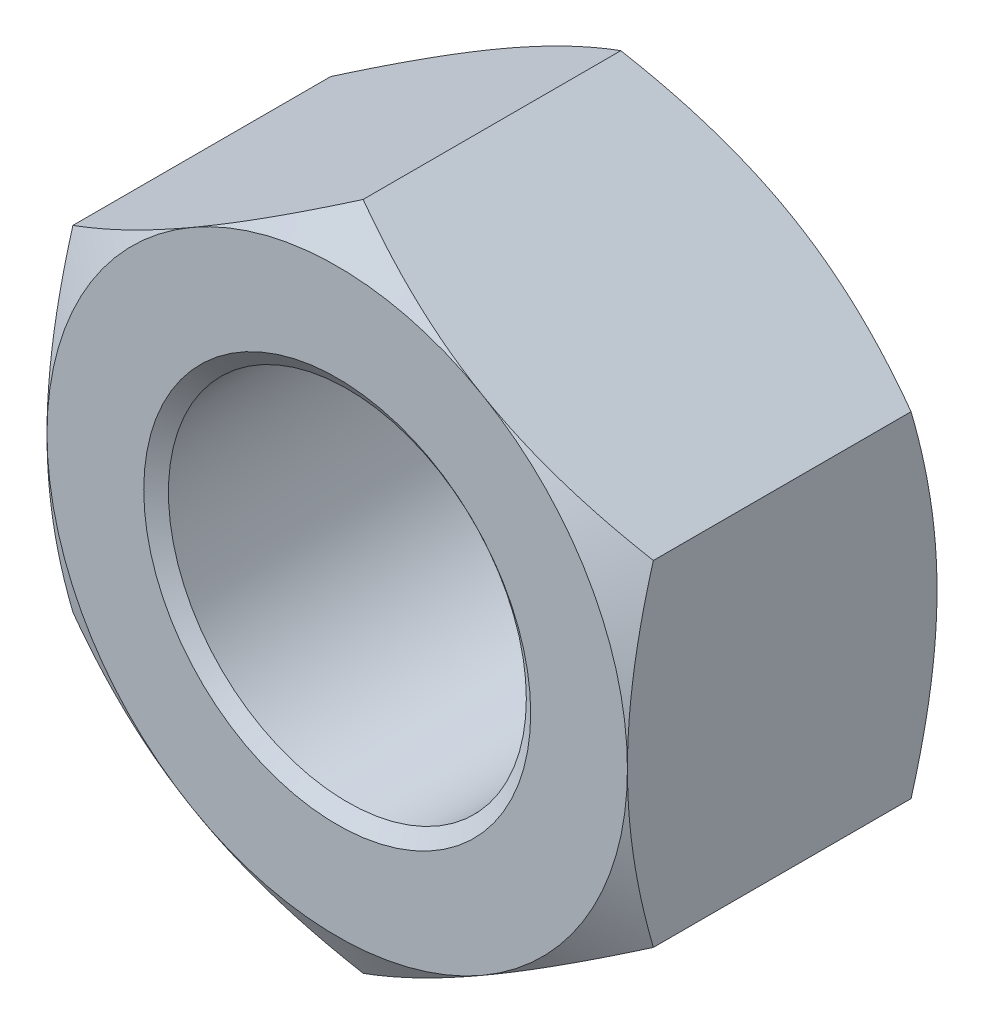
ISO-10303-21;
HEADER;
FILE_DESCRIPTION(('STEP AP214'),'2;1');
FILE_NAME('part.step','',(''),(''),'','','');
FILE_SCHEMA(('AUTOMOTIVE_DESIGN { 1 0 10303 214 1 1 1 1 }'));
ENDSEC;
DATA;
#1=APPLICATION_CONTEXT('core data for automotive mechanical design processes');
#2=APPLICATION_PROTOCOL_DEFINITION('international standard','automotive_design',2000,#1);
#3=PRODUCT_CONTEXT('',#1,'mechanical');
#4=PRODUCT('Part','Part','',(#3));
#5=PRODUCT_RELATED_PRODUCT_CATEGORY('part','',(#4));
#6=PRODUCT_DEFINITION_FORMATION('','',#4);
#7=PRODUCT_DEFINITION_CONTEXT('part definition',#1,'design');
#8=PRODUCT_DEFINITION('design','',#6,#7);
#9=PRODUCT_DEFINITION_SHAPE('','',#8);
#10=(LENGTH_UNIT() NAMED_UNIT(*) SI_UNIT(.MILLI.,.METRE.));
#11=(NAMED_UNIT(*) PLANE_ANGLE_UNIT() SI_UNIT($,.RADIAN.));
#12=(NAMED_UNIT(*) SI_UNIT($,.STERADIAN.) SOLID_ANGLE_UNIT());
#13=UNCERTAINTY_MEASURE_WITH_UNIT(LENGTH_MEASURE(1.E-05),#10,'distance_accuracy_value','');
#14=(GEOMETRIC_REPRESENTATION_CONTEXT(3) GLOBAL_UNCERTAINTY_ASSIGNED_CONTEXT((#13)) GLOBAL_UNIT_ASSIGNED_CONTEXT((#10,
#11,#12)) REPRESENTATION_CONTEXT('',''));
#15=CARTESIAN_POINT('',(0.,0.,0.));
#16=DIRECTION('',(0.,0.,1.));
#17=DIRECTION('',(1.,0.,0.));
#18=AXIS2_PLACEMENT_3D('',#15,#16,#17);
#19=CARTESIAN_POINT('',(0.,0.,-16.));
#20=DIRECTION('',(0.,0.,1.));
#21=DIRECTION('',(1.,0.,0.));
#22=AXIS2_PLACEMENT_3D('',#19,#20,#21);
#23=CYLINDRICAL_SURFACE('',#22,9.25);
#24=CARTESIAN_POINT('',(0.,0.,-0.525155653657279));
#25=DIRECTION('',(0.,0.,1.));
#26=DIRECTION('',(1.,0.,0.));
#27=AXIS2_PLACEMENT_3D('',#24,#25,#26);
#28=CIRCLE('',#27,9.25);
#29=CARTESIAN_POINT('',(9.25,0.,-0.525155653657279));
#30=VERTEX_POINT('',#29);
#31=EDGE_CURVE('E196',#30,#30,#28,.F.);
#32=ORIENTED_EDGE('',*,*,#31,.F.);
#33=EDGE_LOOP('',(#32));
#34=FACE_BOUND('',#33,.T.);
#35=CARTESIAN_POINT('',(0.,0.,-15.4494443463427));
#36=DIRECTION('',(0.,0.,-1.));
#37=DIRECTION('',(-1.,0.,0.));
#38=AXIS2_PLACEMENT_3D('',#35,#36,#37);
#39=CIRCLE('',#38,9.25);
#40=CARTESIAN_POINT('',(-9.25,0.,-15.4494443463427));
#41=VERTEX_POINT('',#40);
#42=EDGE_CURVE('E50',#41,#41,#39,.F.);
#43=ORIENTED_EDGE('',*,*,#42,.F.);
#44=EDGE_LOOP('',(#43));
#45=FACE_BOUND('',#44,.T.);
#46=ADVANCED_FACE('F45',(#34,#45),#23,.F.);
#47=CARTESIAN_POINT('',(0.,17.3205080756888,-16.));
#48=DIRECTION('',(-0.500000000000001,0.866025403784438,0.));
#49=DIRECTION('',(-0.866025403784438,-0.500000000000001,0.));
#50=AXIS2_PLACEMENT_3D('',#47,#48,#49);
#51=PLANE('',#50);
#52=DIRECTION('',(0.,0.,1.));
#53=VECTOR('',#52,1.);
#54=CARTESIAN_POINT('',(-15.,8.66025403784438,-16.));
#55=LINE('',#54,#53);
#56=CARTESIAN_POINT('',(-15.,8.66025403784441,-14.6602540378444));
#57=VERTEX_POINT('',#56);
#58=CARTESIAN_POINT('',(-15.,8.66025403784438,-1.33974596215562));
#59=VERTEX_POINT('',#58);
#60=EDGE_CURVE('E183',#57,#59,#55,.T.);
#61=ORIENTED_EDGE('',*,*,#60,.T.);
#62=CARTESIAN_POINT('',(-15.0002,8.66013856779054,-1.33981262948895));
#63=CARTESIAN_POINT('',(-14.6705058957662,8.85048754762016,-1.22992178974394));
#64=CARTESIAN_POINT('',(-14.3395258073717,9.04157899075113,-1.12501758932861));
#65=CARTESIAN_POINT('',(-13.674911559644,9.42529420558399,-0.926568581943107));
#66=CARTESIAN_POINT('',(-13.3412765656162,9.61791845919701,-0.833027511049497));
#67=CARTESIAN_POINT('',(-12.6707077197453,10.0050715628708,-0.658562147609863));
#68=CARTESIAN_POINT('',(-12.333767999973,10.199603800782,-0.577667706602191));
#69=CARTESIAN_POINT('',(-11.6575472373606,10.5900200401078,-0.430232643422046));
#70=CARTESIAN_POINT('',(-11.3182663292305,10.7859039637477,-0.363691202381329));
#71=CARTESIAN_POINT('',(-10.6460568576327,11.1740042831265,-0.24779237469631));
#72=CARTESIAN_POINT('',(-10.3131781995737,11.3661918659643,-0.198051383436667));
#73=CARTESIAN_POINT('',(-9.6458955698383,11.7514476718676,-0.114646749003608));
#74=CARTESIAN_POINT('',(-9.3114915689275,11.9445159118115,-0.0809834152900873));
#75=CARTESIAN_POINT('',(-8.64212181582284,12.3309767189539,-0.0305840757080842));
#76=CARTESIAN_POINT('',(-8.30715720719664,12.5243686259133,-0.0138279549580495));
#77=CARTESIAN_POINT('',(-7.63691878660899,12.9113309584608,0.00239660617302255));
#78=CARTESIAN_POINT('',(-7.30164498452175,13.1049013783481,0.00186558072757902));
#79=CARTESIAN_POINT('',(-6.67485311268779,13.4667798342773,-0.0152766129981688));
#80=CARTESIAN_POINT('',(-6.38329037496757,13.6351136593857,-0.0297968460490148));
#81=CARTESIAN_POINT('',(-5.80083556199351,13.9713941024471,-0.0716371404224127));
#82=CARTESIAN_POINT('',(-5.50994353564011,14.1393406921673,-0.0989581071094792));
#83=CARTESIAN_POINT('',(-4.92898814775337,14.4747554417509,-0.165923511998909));
#84=CARTESIAN_POINT('',(-4.63892567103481,14.6422230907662,-0.205578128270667));
#85=CARTESIAN_POINT('',(-4.06016058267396,14.9763732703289,-0.29651510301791));
#86=CARTESIAN_POINT('',(-3.77145806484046,15.1430557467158,-0.347798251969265));
#87=CARTESIAN_POINT('',(-2.89508556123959,15.6490296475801,-0.520386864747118));
#88=CARTESIAN_POINT('',(-2.30995340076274,15.9868558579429,-0.658901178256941));
#89=CARTESIAN_POINT('',(-1.14841408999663,16.6574708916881,-0.973271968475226));
#90=CARTESIAN_POINT('',(-0.571992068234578,16.9902683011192,-1.14905461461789));
#91=CARTESIAN_POINT('',(0.000200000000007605,17.3206235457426,-1.33981262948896));
#92=B_SPLINE_CURVE_WITH_KNOTS('',3,(#62,#63,#64,#65,#66,#67,#68,#69,#70,#71,#72,#73,#74,#75,#76,
#77,#78,#79,#80,#81,#82,#83,#84,#85,#86,#87,#88,#89,#90,#91),.UNSPECIFIED.,.F.,.F.,(4,2,2,2,2,2,
2,2,2,2,2,2,2,2,4),(0.,1.18875411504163,2.37789802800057,3.56980778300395,4.76164951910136,
5.92407379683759,7.08652044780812,8.24758247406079,9.40860862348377,10.4193068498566,
11.4300765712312,12.4416826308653,13.4533574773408,15.5211962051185,17.5849760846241),.UNSPECIFIED.);
#93=CARTESIAN_POINT('',(-7.50000000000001,12.9903810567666,0.));
#94=VERTEX_POINT('',#93);
#95=EDGE_CURVE('E146',#59,#94,#92,.T.);
#96=ORIENTED_EDGE('',*,*,#95,.T.);
#97=CARTESIAN_POINT('',(0.,17.3205080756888,-1.33974596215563));
#98=VERTEX_POINT('',#97);
#99=EDGE_CURVE('E65',#94,#98,#92,.T.);
#100=ORIENTED_EDGE('',*,*,#99,.T.);
#101=DIRECTION('',(0.,0.,1.));
#102=VECTOR('',#101,1.);
#103=CARTESIAN_POINT('',(0.,17.3205080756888,-16.));
#104=LINE('',#103,#102);
#105=CARTESIAN_POINT('',(0.,17.3205080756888,-14.6602540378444));
#106=VERTEX_POINT('',#105);
#107=EDGE_CURVE('E164',#106,#98,#104,.T.);
#108=ORIENTED_EDGE('',*,*,#107,.F.);
#109=CARTESIAN_POINT('',(-15.0002,8.66013856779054,-14.6601873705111));
#110=CARTESIAN_POINT('',(-14.6705058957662,8.85048754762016,-14.7700782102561));
#111=CARTESIAN_POINT('',(-14.3395258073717,9.04157899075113,-14.8749824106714));
#112=CARTESIAN_POINT('',(-13.674911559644,9.42529420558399,-15.0734314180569));
#113=CARTESIAN_POINT('',(-13.3412765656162,9.61791845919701,-15.1669724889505));
#114=CARTESIAN_POINT('',(-12.6707077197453,10.0050715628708,-15.3414378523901));
#115=CARTESIAN_POINT('',(-12.333767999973,10.199603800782,-15.4223322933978));
#116=CARTESIAN_POINT('',(-11.6575472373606,10.5900200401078,-15.569767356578));
#117=CARTESIAN_POINT('',(-11.3182663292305,10.7859039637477,-15.6363087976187));
#118=CARTESIAN_POINT('',(-10.6460568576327,11.1740042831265,-15.7522076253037));
#119=CARTESIAN_POINT('',(-10.3131781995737,11.3661918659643,-15.8019486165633));
#120=CARTESIAN_POINT('',(-9.6458955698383,11.7514476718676,-15.8853532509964));
#121=CARTESIAN_POINT('',(-9.3114915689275,11.9445159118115,-15.9190165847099));
#122=CARTESIAN_POINT('',(-8.64212181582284,12.3309767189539,-15.9694159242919));
#123=CARTESIAN_POINT('',(-8.30715720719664,12.5243686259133,-15.9861720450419));
#124=CARTESIAN_POINT('',(-7.63691878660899,12.9113309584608,-16.002396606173));
#125=CARTESIAN_POINT('',(-7.30164498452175,13.1049013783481,-16.0018655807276));
#126=CARTESIAN_POINT('',(-6.67485311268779,13.4667798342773,-15.9847233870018));
#127=CARTESIAN_POINT('',(-6.38329037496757,13.6351136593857,-15.970203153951));
#128=CARTESIAN_POINT('',(-5.80083556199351,13.9713941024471,-15.9283628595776));
#129=CARTESIAN_POINT('',(-5.5099435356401,14.1393406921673,-15.9010418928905));
#130=CARTESIAN_POINT('',(-4.92898814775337,14.4747554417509,-15.8340764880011));
#131=CARTESIAN_POINT('',(-4.63892567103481,14.6422230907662,-15.7944218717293));
#132=CARTESIAN_POINT('',(-4.06016058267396,14.9763732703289,-15.7034848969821));
#133=CARTESIAN_POINT('',(-3.77145806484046,15.1430557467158,-15.6522017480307));
#134=CARTESIAN_POINT('',(-2.89508556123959,15.6490296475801,-15.4796131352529));
#135=CARTESIAN_POINT('',(-2.30995340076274,15.9868558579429,-15.3410988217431));
#136=CARTESIAN_POINT('',(-1.14841408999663,16.6574708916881,-15.0267280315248));
#137=CARTESIAN_POINT('',(-0.571992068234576,16.9902683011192,-14.8509453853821));
#138=CARTESIAN_POINT('',(0.00020000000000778,17.3206235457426,-14.660187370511));
#139=B_SPLINE_CURVE_WITH_KNOTS('',3,(#109,#110,#111,#112,#113,#114,#115,#116,#117,#118,#119,
#120,#121,#122,#123,#124,#125,#126,#127,#128,#129,#130,#131,#132,#133,#134,#135,#136,#137,#138),
.UNSPECIFIED.,.F.,.F.,(4,2,2,2,2,2,2,2,2,2,2,2,2,2,4),(0.,1.18875411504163,2.37789802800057,
3.56980778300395,4.76164951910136,5.92407379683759,7.08652044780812,8.24758247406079,
9.40860862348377,10.4193068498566,11.4300765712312,12.4416826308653,13.4533574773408,
15.5211962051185,17.5849760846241),.UNSPECIFIED.);
#140=CARTESIAN_POINT('',(-7.50000000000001,12.9903810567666,-16.));
#141=VERTEX_POINT('',#140);
#142=EDGE_CURVE('E187',#141,#106,#139,.T.);
#143=ORIENTED_EDGE('',*,*,#142,.F.);
#144=EDGE_CURVE('E297',#57,#141,#139,.T.);
#145=ORIENTED_EDGE('',*,*,#144,.F.);
#146=EDGE_LOOP('',(#61,#96,#100,#108,#143,#145));
#147=FACE_BOUND('',#146,.T.);
#148=ADVANCED_FACE('F47',(#147),#51,.T.);
#149=CARTESIAN_POINT('',(15.,8.66025403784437,-16.));
#150=DIRECTION('',(0.500000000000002,0.866025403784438,0.));
#151=DIRECTION('',(-0.866025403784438,0.500000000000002,0.));
#152=AXIS2_PLACEMENT_3D('',#149,#150,#151);
#153=PLANE('',#152);
#154=ORIENTED_EDGE('',*,*,#107,.T.);
#155=CARTESIAN_POINT('',(-0.000199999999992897,17.3206235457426,-1.33981262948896));
#156=CARTESIAN_POINT('',(0.329494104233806,17.130274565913,-1.22992178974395));
#157=CARTESIAN_POINT('',(0.660474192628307,16.939183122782,-1.12501758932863));
#158=CARTESIAN_POINT('',(1.32508844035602,16.5554679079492,-0.926568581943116));
#159=CARTESIAN_POINT('',(1.65872343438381,16.3628436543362,-0.833027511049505));
#160=CARTESIAN_POINT('',(2.32929228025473,15.9756905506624,-0.65856214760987));
#161=CARTESIAN_POINT('',(2.66623200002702,15.7811583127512,-0.577667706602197));
#162=CARTESIAN_POINT('',(3.34245276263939,15.3907420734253,-0.430232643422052));
#163=CARTESIAN_POINT('',(3.68173367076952,15.1948581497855,-0.363691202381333));
#164=CARTESIAN_POINT('',(4.35394314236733,14.8067578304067,-0.247792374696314));
#165=CARTESIAN_POINT('',(4.68682180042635,14.6145702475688,-0.198051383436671));
#166=CARTESIAN_POINT('',(5.35410443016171,14.2293144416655,-0.114646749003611));
#167=CARTESIAN_POINT('',(5.68850843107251,14.0362462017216,-0.0809834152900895));
#168=CARTESIAN_POINT('',(6.35787818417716,13.6497853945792,-0.030584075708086));
#169=CARTESIAN_POINT('',(6.69284279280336,13.4563934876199,-0.0138279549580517));
#170=CARTESIAN_POINT('',(7.36308121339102,13.0694311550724,0.00239660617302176));
#171=CARTESIAN_POINT('',(7.69835501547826,12.8758607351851,0.00186558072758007));
#172=CARTESIAN_POINT('',(8.32514688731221,12.5139822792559,-0.0152766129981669));
#173=CARTESIAN_POINT('',(8.61670962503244,12.3456484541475,-0.0297968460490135));
#174=CARTESIAN_POINT('',(9.19916443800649,12.0093680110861,-0.0716371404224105));
#175=CARTESIAN_POINT('',(9.4900564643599,11.8414214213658,-0.0989581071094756));
#176=CARTESIAN_POINT('',(10.0710118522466,11.5060066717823,-0.165923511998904));
#177=CARTESIAN_POINT('',(10.3610743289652,11.338539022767,-0.205578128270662));
#178=CARTESIAN_POINT('',(10.939839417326,11.0043888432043,-0.296515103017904));
#179=CARTESIAN_POINT('',(11.2285419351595,10.8377063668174,-0.347798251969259));
#180=CARTESIAN_POINT('',(12.1049144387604,10.3317324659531,-0.52038686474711));
#181=CARTESIAN_POINT('',(12.6900465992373,9.99390625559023,-0.658901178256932));
#182=CARTESIAN_POINT('',(13.8515859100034,9.32329122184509,-0.973271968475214));
#183=CARTESIAN_POINT('',(14.4280079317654,8.99049381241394,-1.14905461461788));
#184=CARTESIAN_POINT('',(15.0002,8.66013856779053,-1.33981262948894));
#185=B_SPLINE_CURVE_WITH_KNOTS('',3,(#155,#156,#157,#158,#159,#160,#161,#162,#163,#164,#165,
#166,#167,#168,#169,#170,#171,#172,#173,#174,#175,#176,#177,#178,#179,#180,#181,#182,#183,#184),
.UNSPECIFIED.,.F.,.F.,(4,2,2,2,2,2,2,2,2,2,2,2,2,2,4),(0.,1.18875411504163,2.37789802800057,
3.56980778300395,4.76164951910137,5.9240737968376,7.08652044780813,8.2475824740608,
9.40860862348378,10.4193068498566,11.4300765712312,12.4416826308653,13.4533574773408,
15.5211962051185,17.5849760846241),.UNSPECIFIED.);
#186=CARTESIAN_POINT('',(7.50000000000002,12.9903810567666,0.));
#187=VERTEX_POINT('',#186);
#188=EDGE_CURVE('E156',#98,#187,#185,.T.);
#189=ORIENTED_EDGE('',*,*,#188,.T.);
#190=CARTESIAN_POINT('',(15.,8.66025403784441,-1.33974596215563));
#191=VERTEX_POINT('',#190);
#192=EDGE_CURVE('E72',#187,#191,#185,.T.);
#193=ORIENTED_EDGE('',*,*,#192,.T.);
#194=DIRECTION('',(0.,0.,1.));
#195=VECTOR('',#194,1.);
#196=CARTESIAN_POINT('',(15.,8.66025403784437,-16.));
#197=LINE('',#196,#195);
#198=CARTESIAN_POINT('',(15.,8.66025403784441,-14.6602540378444));
#199=VERTEX_POINT('',#198);
#200=EDGE_CURVE('E155',#199,#191,#197,.T.);
#201=ORIENTED_EDGE('',*,*,#200,.F.);
#202=CARTESIAN_POINT('',(-0.000199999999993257,17.3206235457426,-14.660187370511));
#203=CARTESIAN_POINT('',(0.329494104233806,17.130274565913,-14.770078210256));
#204=CARTESIAN_POINT('',(0.660474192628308,16.939183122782,-14.8749824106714));
#205=CARTESIAN_POINT('',(1.32508844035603,16.5554679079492,-15.0734314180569));
#206=CARTESIAN_POINT('',(1.65872343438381,16.3628436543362,-15.1669724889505));
#207=CARTESIAN_POINT('',(2.32929228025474,15.9756905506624,-15.3414378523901));
#208=CARTESIAN_POINT('',(2.66623200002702,15.7811583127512,-15.4223322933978));
#209=CARTESIAN_POINT('',(3.34245276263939,15.3907420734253,-15.5697673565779));
#210=CARTESIAN_POINT('',(3.68173367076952,15.1948581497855,-15.6363087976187));
#211=CARTESIAN_POINT('',(4.35394314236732,14.8067578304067,-15.7522076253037));
#212=CARTESIAN_POINT('',(4.68682180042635,14.6145702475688,-15.8019486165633));
#213=CARTESIAN_POINT('',(5.3541044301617,14.2293144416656,-15.8853532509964));
#214=CARTESIAN_POINT('',(5.6885084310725,14.0362462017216,-15.9190165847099));
#215=CARTESIAN_POINT('',(6.35787818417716,13.6497853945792,-15.9694159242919));
#216=CARTESIAN_POINT('',(6.69284279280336,13.4563934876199,-15.9861720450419));
#217=CARTESIAN_POINT('',(7.36308121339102,13.0694311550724,-16.002396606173));
#218=CARTESIAN_POINT('',(7.69835501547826,12.8758607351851,-16.0018655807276));
#219=CARTESIAN_POINT('',(8.32514688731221,12.5139822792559,-15.9847233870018));
#220=CARTESIAN_POINT('',(8.61670962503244,12.3456484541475,-15.970203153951));
#221=CARTESIAN_POINT('',(9.19916443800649,12.0093680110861,-15.9283628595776));
#222=CARTESIAN_POINT('',(9.4900564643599,11.8414214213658,-15.9010418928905));
#223=CARTESIAN_POINT('',(10.0710118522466,11.5060066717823,-15.8340764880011));
#224=CARTESIAN_POINT('',(10.3610743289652,11.338539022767,-15.7944218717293));
#225=CARTESIAN_POINT('',(10.939839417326,11.0043888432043,-15.7034848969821));
#226=CARTESIAN_POINT('',(11.2285419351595,10.8377063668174,-15.6522017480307));
#227=CARTESIAN_POINT('',(12.1049144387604,10.3317324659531,-15.4796131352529));
#228=CARTESIAN_POINT('',(12.6900465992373,9.99390625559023,-15.3410988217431));
#229=CARTESIAN_POINT('',(13.8515859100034,9.32329122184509,-15.0267280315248));
#230=CARTESIAN_POINT('',(14.4280079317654,8.99049381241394,-14.8509453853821));
#231=CARTESIAN_POINT('',(15.0002,8.66013856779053,-14.6601873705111));
#232=B_SPLINE_CURVE_WITH_KNOTS('',3,(#202,#203,#204,#205,#206,#207,#208,#209,#210,#211,#212,
#213,#214,#215,#216,#217,#218,#219,#220,#221,#222,#223,#224,#225,#226,#227,#228,#229,#230,#231),
.UNSPECIFIED.,.F.,.F.,(4,2,2,2,2,2,2,2,2,2,2,2,2,2,4),(0.,1.18875411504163,2.37789802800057,
3.56980778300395,4.76164951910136,5.92407379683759,7.08652044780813,8.24758247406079,
9.40860862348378,10.4193068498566,11.4300765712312,12.4416826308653,13.4533574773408,
15.5211962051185,17.5849760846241),.UNSPECIFIED.);
#233=CARTESIAN_POINT('',(7.50000000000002,12.9903810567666,-16.));
#234=VERTEX_POINT('',#233);
#235=EDGE_CURVE('E289',#234,#199,#232,.T.);
#236=ORIENTED_EDGE('',*,*,#235,.F.);
#237=EDGE_CURVE('E296',#106,#234,#232,.T.);
#238=ORIENTED_EDGE('',*,*,#237,.F.);
#239=EDGE_LOOP('',(#154,#189,#193,#201,#236,#238));
#240=FACE_BOUND('',#239,.T.);
#241=ADVANCED_FACE('F153',(#240),#153,.T.);
#242=CARTESIAN_POINT('',(15.,8.66025403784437,-16.));
#243=DIRECTION('',(-1.,0.,0.));
#244=DIRECTION('',(0.,0.,1.));
#245=AXIS2_PLACEMENT_3D('',#242,#243,#244);
#246=PLANE('',#245);
#247=CARTESIAN_POINT('',(15.,-22.9682699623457,-7.1779005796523));
#248=CARTESIAN_POINT('',(15.,-22.6389897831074,-7.01873142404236));
#249=CARTESIAN_POINT('',(15.,-22.3093116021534,-6.8603860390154));
#250=CARTESIAN_POINT('',(15.,-21.6490751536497,-6.54553189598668));
#251=CARTESIAN_POINT('',(15.,-21.3185168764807,-6.38902315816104));
#252=CARTESIAN_POINT('',(15.,-20.3252989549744,-5.92249019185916));
#253=CARTESIAN_POINT('',(15.,-19.6612032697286,-5.61551110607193));
#254=CARTESIAN_POINT('',(15.,-18.3246226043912,-5.00989859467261));
#255=CARTESIAN_POINT('',(15.,-17.6521113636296,-4.711322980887));
#256=CARTESIAN_POINT('',(15.,-16.3015621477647,-4.12699119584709));
#257=CARTESIAN_POINT('',(15.,-15.6235244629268,-3.84123435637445));
#258=CARTESIAN_POINT('',(15.,-14.2524269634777,-3.28256457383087));
#259=CARTESIAN_POINT('',(15.,-13.5592849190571,-3.00985238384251));
#260=CARTESIAN_POINT('',(15.,-12.1648203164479,-2.48578579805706));
#261=CARTESIAN_POINT('',(15.,-11.4634968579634,-2.23443377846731));
#262=CARTESIAN_POINT('',(15.,-10.0530172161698,-1.75984469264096));
#263=CARTESIAN_POINT('',(15.,-9.34388131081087,-1.53654785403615));
#264=CARTESIAN_POINT('',(15.,-7.91545988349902,-1.12531011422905));
#265=CARTESIAN_POINT('',(15.,-7.19617764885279,-0.937358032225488));
#266=CARTESIAN_POINT('',(15.,-6.10950776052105,-0.688818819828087));
#267=CARTESIAN_POINT('',(15.,-5.74591626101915,-0.611524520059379));
#268=CARTESIAN_POINT('',(15.,-5.01631310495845,-0.469286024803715));
#269=CARTESIAN_POINT('',(15.,-4.65030150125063,-0.404341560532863));
#270=CARTESIAN_POINT('',(15.,-3.91609659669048,-0.287952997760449));
#271=CARTESIAN_POINT('',(15.,-3.54790312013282,-0.23651000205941));
#272=CARTESIAN_POINT('',(15.,-2.80977894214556,-0.148161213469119));
#273=CARTESIAN_POINT('',(15.,-2.4398483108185,-0.11125483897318));
#274=CARTESIAN_POINT('',(15.,-1.70111543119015,-0.0529692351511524));
#275=CARTESIAN_POINT('',(15.,-1.33232087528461,-0.0314931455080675));
#276=CARTESIAN_POINT('',(15.,-0.594154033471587,-0.00418216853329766));
#277=CARTESIAN_POINT('',(15.,-0.224781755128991,0.00165292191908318));
#278=CARTESIAN_POINT('',(15.,0.513772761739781,-0.00245653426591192));
#279=CARTESIAN_POINT('',(15.,0.882955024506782,-0.0123966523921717));
#280=CARTESIAN_POINT('',(15.,1.62057875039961,-0.0478095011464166));
#281=CARTESIAN_POINT('',(15.,1.98902017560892,-0.0732830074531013));
#282=CARTESIAN_POINT('',(15.,2.8820087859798,-0.153315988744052));
#283=CARTESIAN_POINT('',(15.,3.40586988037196,-0.215658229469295));
#284=CARTESIAN_POINT('',(15.,4.44957771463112,-0.368284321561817));
#285=CARTESIAN_POINT('',(15.,4.96942331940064,-0.458575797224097));
#286=CARTESIAN_POINT('',(15.,6.0046714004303,-0.663898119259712));
#287=CARTESIAN_POINT('',(15.,6.52006919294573,-0.778952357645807));
#288=CARTESIAN_POINT('',(15.,7.54556200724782,-1.030289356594));
#289=CARTESIAN_POINT('',(15.,8.05565752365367,-1.1665701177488));
#290=CARTESIAN_POINT('',(15.,9.08310964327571,-1.46066370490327));
#291=CARTESIAN_POINT('',(15.,9.6003377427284,-1.61892244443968));
#292=CARTESIAN_POINT('',(15.,10.6293258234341,-1.95107200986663));
#293=CARTESIAN_POINT('',(15.,11.1410893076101,-2.1249520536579));
#294=CARTESIAN_POINT('',(15.,12.1570993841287,-2.48477464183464));
#295=CARTESIAN_POINT('',(15.,12.6613720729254,-2.67064378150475));
#296=CARTESIAN_POINT('',(15.,13.4147912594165,-2.95756327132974));
#297=CARTESIAN_POINT('',(15.,13.665486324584,-3.05457748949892));
#298=CARTESIAN_POINT('',(15.,14.1659013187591,-3.2510732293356));
#299=CARTESIAN_POINT('',(15.,14.4156212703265,-3.3505546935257));
#300=CARTESIAN_POINT('',(15.,14.6648887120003,-3.4511587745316));
#301=B_SPLINE_CURVE_WITH_KNOTS('',3,(#247,#248,#249,#250,#251,#252,#253,#254,#255,#256,#257,
#258,#259,#260,#261,#262,#263,#264,#265,#266,#267,#268,#269,#270,#271,#272,#273,#274,#275,#276,
#277,#278,#279,#280,#281,#282,#283,#284,#285,#286,#287,#288,#289,#290,#291,#292,#293,#294,#295,
#296,#297,#298,#299,#300),.UNSPECIFIED.,.F.,.F.,(4,2,2,2,2,2,2,2,2,2,2,2,2,2,2,2,2,2,2,2,2,2,2,
2,2,2,4),(0.,1.09719534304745,2.19440272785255,4.38917437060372,6.59650580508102,
8.80372204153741,11.0380360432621,13.2725982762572,15.502315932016,17.7313270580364,
18.8463006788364,19.9612500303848,21.0762904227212,22.1912861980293,23.2992201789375,
24.4071397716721,25.5147483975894,26.6224123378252,28.2042036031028,29.7864267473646,
31.3701511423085,32.9537264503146,34.5761185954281,36.1973994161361,37.8095545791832,
38.6159794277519,39.4223855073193),.UNSPECIFIED.);
#302=CARTESIAN_POINT('',(15.,-8.66025403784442,-1.33974596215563));
#303=VERTEX_POINT('',#302);
#304=CARTESIAN_POINT('',(15.,0.,0.));
#305=VERTEX_POINT('',#304);
#306=EDGE_CURVE('E148',#303,#305,#301,.T.);
#307=ORIENTED_EDGE('',*,*,#306,.F.);
#308=DIRECTION('',(0.,0.,1.));
#309=VECTOR('',#308,1.);
#310=CARTESIAN_POINT('',(15.,-8.66025403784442,-16.));
#311=LINE('',#310,#309);
#312=CARTESIAN_POINT('',(15.,-8.66025403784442,-14.6602540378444));
#313=VERTEX_POINT('',#312);
#314=EDGE_CURVE('E165',#313,#303,#311,.T.);
#315=ORIENTED_EDGE('',*,*,#314,.F.);
#316=CARTESIAN_POINT('',(15.,-22.9682699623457,-8.8220994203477));
#317=CARTESIAN_POINT('',(15.,-22.6389897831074,-8.98126857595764));
#318=CARTESIAN_POINT('',(15.,-22.3093116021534,-9.1396139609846));
#319=CARTESIAN_POINT('',(15.,-21.6490751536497,-9.45446810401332));
#320=CARTESIAN_POINT('',(15.,-21.3185168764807,-9.61097684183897));
#321=CARTESIAN_POINT('',(15.,-20.3252989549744,-10.0775098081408));
#322=CARTESIAN_POINT('',(15.,-19.6612032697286,-10.3844888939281));
#323=CARTESIAN_POINT('',(15.,-18.3246226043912,-10.9901014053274));
#324=CARTESIAN_POINT('',(15.,-17.6521113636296,-11.288677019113));
#325=CARTESIAN_POINT('',(15.,-16.3015621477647,-11.8730088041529));
#326=CARTESIAN_POINT('',(15.,-15.6235244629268,-12.1587656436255));
#327=CARTESIAN_POINT('',(15.,-14.2524269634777,-12.7174354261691));
#328=CARTESIAN_POINT('',(15.,-13.5592849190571,-12.9901476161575));
#329=CARTESIAN_POINT('',(15.,-12.1648203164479,-13.5142142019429));
#330=CARTESIAN_POINT('',(15.,-11.4634968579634,-13.7655662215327));
#331=CARTESIAN_POINT('',(15.,-10.0530172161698,-14.240155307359));
#332=CARTESIAN_POINT('',(15.,-9.34388131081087,-14.4634521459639));
#333=CARTESIAN_POINT('',(15.,-7.91545988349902,-14.874689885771));
#334=CARTESIAN_POINT('',(15.,-7.19617764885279,-15.0626419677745));
#335=CARTESIAN_POINT('',(15.,-6.10950776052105,-15.3111811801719));
#336=CARTESIAN_POINT('',(15.,-5.74591626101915,-15.3884754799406));
#337=CARTESIAN_POINT('',(15.,-5.01631310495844,-15.5307139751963));
#338=CARTESIAN_POINT('',(15.,-4.65030150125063,-15.5956584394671));
#339=CARTESIAN_POINT('',(15.,-3.91609659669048,-15.7120470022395));
#340=CARTESIAN_POINT('',(15.,-3.54790312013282,-15.7634899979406));
#341=CARTESIAN_POINT('',(15.,-2.80977894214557,-15.8518387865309));
#342=CARTESIAN_POINT('',(15.,-2.4398483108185,-15.8887451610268));
#343=CARTESIAN_POINT('',(15.,-1.70111543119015,-15.9470307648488));
#344=CARTESIAN_POINT('',(15.,-1.33232087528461,-15.9685068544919));
#345=CARTESIAN_POINT('',(15.,-0.594154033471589,-15.9958178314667));
#346=CARTESIAN_POINT('',(15.,-0.224781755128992,-16.0016529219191));
#347=CARTESIAN_POINT('',(15.,0.513772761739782,-15.9975434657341));
#348=CARTESIAN_POINT('',(15.,0.882955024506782,-15.9876033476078));
#349=CARTESIAN_POINT('',(15.,1.62057875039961,-15.9521904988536));
#350=CARTESIAN_POINT('',(15.,1.98902017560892,-15.9267169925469));
#351=CARTESIAN_POINT('',(15.,2.8820087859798,-15.8466840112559));
#352=CARTESIAN_POINT('',(15.,3.40586988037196,-15.7843417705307));
#353=CARTESIAN_POINT('',(15.,4.44957771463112,-15.6317156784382));
#354=CARTESIAN_POINT('',(15.,4.96942331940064,-15.5414242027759));
#355=CARTESIAN_POINT('',(15.,6.0046714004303,-15.3361018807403));
#356=CARTESIAN_POINT('',(15.,6.52006919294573,-15.2210476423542));
#357=CARTESIAN_POINT('',(15.,7.54556200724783,-14.969710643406));
#358=CARTESIAN_POINT('',(15.,8.05565752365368,-14.8334298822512));
#359=CARTESIAN_POINT('',(15.,9.08310964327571,-14.5393362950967));
#360=CARTESIAN_POINT('',(15.,9.6003377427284,-14.3810775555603));
#361=CARTESIAN_POINT('',(15.,10.6293258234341,-14.0489279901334));
#362=CARTESIAN_POINT('',(15.,11.1410893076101,-13.8750479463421));
#363=CARTESIAN_POINT('',(15.,12.1570993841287,-13.5152253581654));
#364=CARTESIAN_POINT('',(15.,12.6613720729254,-13.3293562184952));
#365=CARTESIAN_POINT('',(15.,13.4147912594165,-13.0424367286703));
#366=CARTESIAN_POINT('',(15.,13.665486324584,-12.9454225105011));
#367=CARTESIAN_POINT('',(15.,14.1659013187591,-12.7489267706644));
#368=CARTESIAN_POINT('',(15.,14.4156212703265,-12.6494453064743));
#369=CARTESIAN_POINT('',(15.,14.6648887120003,-12.5488412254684));
#370=B_SPLINE_CURVE_WITH_KNOTS('',3,(#316,#317,#318,#319,#320,#321,#322,#323,#324,#325,#326,
#327,#328,#329,#330,#331,#332,#333,#334,#335,#336,#337,#338,#339,#340,#341,#342,#343,#344,#345,
#346,#347,#348,#349,#350,#351,#352,#353,#354,#355,#356,#357,#358,#359,#360,#361,#362,#363,#364,
#365,#366,#367,#368,#369),.UNSPECIFIED.,.F.,.F.,(4,2,2,2,2,2,2,2,2,2,2,2,2,2,2,2,2,2,2,2,2,2,2,
2,2,2,4),(0.,1.09719534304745,2.19440272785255,4.38917437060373,6.59650580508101,
8.80372204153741,11.0380360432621,13.2725982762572,15.502315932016,17.7313270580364,
18.8463006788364,19.9612500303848,21.0762904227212,22.1912861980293,23.2992201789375,
24.4071397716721,25.5147483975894,26.6224123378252,28.2042036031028,29.7864267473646,
31.3701511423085,32.9537264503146,34.5761185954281,36.1973994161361,37.8095545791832,
38.6159794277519,39.4223855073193),.UNSPECIFIED.);
#371=CARTESIAN_POINT('',(15.,0.,-16.));
#372=VERTEX_POINT('',#371);
#373=EDGE_CURVE('E305',#313,#372,#370,.T.);
#374=ORIENTED_EDGE('',*,*,#373,.T.);
#375=EDGE_CURVE('E162',#372,#199,#370,.T.);
#376=ORIENTED_EDGE('',*,*,#375,.T.);
#377=ORIENTED_EDGE('',*,*,#200,.T.);
#378=EDGE_CURVE('E137',#305,#191,#301,.T.);
#379=ORIENTED_EDGE('',*,*,#378,.F.);
#380=EDGE_LOOP('',(#307,#315,#374,#376,#377,#379));
#381=FACE_BOUND('',#380,.T.);
#382=ADVANCED_FACE('F160',(#381),#246,.F.);
#383=CARTESIAN_POINT('',(0.,-17.3205080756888,-16.));
#384=DIRECTION('',(0.500000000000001,-0.866025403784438,0.));
#385=DIRECTION('',(0.866025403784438,0.500000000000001,0.));
#386=AXIS2_PLACEMENT_3D('',#383,#384,#385);
#387=PLANE('',#386);
#388=ORIENTED_EDGE('',*,*,#314,.T.);
#389=CARTESIAN_POINT('',(15.0002,-8.66013856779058,-1.33981262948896));
#390=CARTESIAN_POINT('',(14.6705058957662,-8.85048754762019,-1.22992178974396));
#391=CARTESIAN_POINT('',(14.3395258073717,-9.04157899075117,-1.12501758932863));
#392=CARTESIAN_POINT('',(13.674911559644,-9.42529420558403,-0.926568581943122));
#393=CARTESIAN_POINT('',(13.3412765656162,-9.61791845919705,-0.833027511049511));
#394=CARTESIAN_POINT('',(12.6707077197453,-10.0050715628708,-0.658562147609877));
#395=CARTESIAN_POINT('',(12.333767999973,-10.199603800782,-0.577667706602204));
#396=CARTESIAN_POINT('',(11.6575472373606,-10.5900200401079,-0.43023264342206));
#397=CARTESIAN_POINT('',(11.3182663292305,-10.7859039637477,-0.363691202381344));
#398=CARTESIAN_POINT('',(10.6460568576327,-11.1740042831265,-0.247792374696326));
#399=CARTESIAN_POINT('',(10.3131781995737,-11.3661918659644,-0.198051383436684));
#400=CARTESIAN_POINT('',(9.6458955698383,-11.7514476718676,-0.114646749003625));
#401=CARTESIAN_POINT('',(9.3114915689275,-11.9445159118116,-0.0809834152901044));
#402=CARTESIAN_POINT('',(8.64212181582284,-12.330976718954,-0.0305840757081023));
#403=CARTESIAN_POINT('',(8.30715720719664,-12.5243686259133,-0.0138279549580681));
#404=CARTESIAN_POINT('',(7.63691878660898,-12.9113309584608,0.00239660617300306));
#405=CARTESIAN_POINT('',(7.30164498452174,-13.1049013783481,0.00186558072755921));
#406=CARTESIAN_POINT('',(6.67485311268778,-13.4667798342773,-0.0152766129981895));
#407=CARTESIAN_POINT('',(6.38329037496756,-13.6351136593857,-0.029796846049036));
#408=CARTESIAN_POINT('',(5.80083556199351,-13.9713941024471,-0.0716371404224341));
#409=CARTESIAN_POINT('',(5.5099435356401,-14.1393406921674,-0.0989581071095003));
#410=CARTESIAN_POINT('',(4.92898814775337,-14.4747554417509,-0.165923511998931));
#411=CARTESIAN_POINT('',(4.63892567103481,-14.6422230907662,-0.205578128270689));
#412=CARTESIAN_POINT('',(4.06016058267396,-14.9763732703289,-0.296515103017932));
#413=CARTESIAN_POINT('',(3.77145806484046,-15.1430557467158,-0.347798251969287));
#414=CARTESIAN_POINT('',(2.89508556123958,-15.6490296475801,-0.520386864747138));
#415=CARTESIAN_POINT('',(2.30995340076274,-15.986855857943,-0.658901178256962));
#416=CARTESIAN_POINT('',(1.14841408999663,-16.6574708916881,-0.973271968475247));
#417=CARTESIAN_POINT('',(0.571992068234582,-16.9902683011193,-1.14905461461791));
#418=CARTESIAN_POINT('',(-0.000200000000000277,-17.3206235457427,-1.33981262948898));
#419=B_SPLINE_CURVE_WITH_KNOTS('',3,(#389,#390,#391,#392,#393,#394,#395,#396,#397,#398,#399,
#400,#401,#402,#403,#404,#405,#406,#407,#408,#409,#410,#411,#412,#413,#414,#415,#416,#417,#418),
.UNSPECIFIED.,.F.,.F.,(4,2,2,2,2,2,2,2,2,2,2,2,2,2,4),(0.,1.18875411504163,2.37789802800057,
3.56980778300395,4.76164951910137,5.92407379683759,7.08652044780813,8.2475824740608,
9.40860862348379,10.4193068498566,11.4300765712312,12.4416826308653,13.4533574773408,
15.5211962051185,17.5849760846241),.UNSPECIFIED.);
#420=CARTESIAN_POINT('',(7.50000000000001,-12.9903810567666,0.));
#421=VERTEX_POINT('',#420);
#422=EDGE_CURVE('E395',#303,#421,#419,.T.);
#423=ORIENTED_EDGE('',*,*,#422,.T.);
#424=CARTESIAN_POINT('',(0.,-17.3205080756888,-1.33974596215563));
#425=VERTEX_POINT('',#424);
#426=EDGE_CURVE('E256',#421,#425,#419,.T.);
#427=ORIENTED_EDGE('',*,*,#426,.T.);
#428=DIRECTION('',(0.,0.,1.));
#429=VECTOR('',#428,1.);
#430=CARTESIAN_POINT('',(0.,-17.3205080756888,-16.));
#431=LINE('',#430,#429);
#432=CARTESIAN_POINT('',(0.,-17.3205080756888,-14.6602540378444));
#433=VERTEX_POINT('',#432);
#434=EDGE_CURVE('E172',#433,#425,#431,.T.);
#435=ORIENTED_EDGE('',*,*,#434,.F.);
#436=CARTESIAN_POINT('',(15.0002,-8.66013856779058,-14.660187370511));
#437=CARTESIAN_POINT('',(14.6705058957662,-8.85048754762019,-14.770078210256));
#438=CARTESIAN_POINT('',(14.3395258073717,-9.04157899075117,-14.8749824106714));
#439=CARTESIAN_POINT('',(13.674911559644,-9.42529420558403,-15.0734314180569));
#440=CARTESIAN_POINT('',(13.3412765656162,-9.61791845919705,-15.1669724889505));
#441=CARTESIAN_POINT('',(12.6707077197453,-10.0050715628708,-15.3414378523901));
#442=CARTESIAN_POINT('',(12.333767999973,-10.199603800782,-15.4223322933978));
#443=CARTESIAN_POINT('',(11.6575472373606,-10.5900200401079,-15.5697673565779));
#444=CARTESIAN_POINT('',(11.3182663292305,-10.7859039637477,-15.6363087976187));
#445=CARTESIAN_POINT('',(10.6460568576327,-11.1740042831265,-15.7522076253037));
#446=CARTESIAN_POINT('',(10.3131781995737,-11.3661918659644,-15.8019486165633));
#447=CARTESIAN_POINT('',(9.6458955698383,-11.7514476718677,-15.8853532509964));
#448=CARTESIAN_POINT('',(9.3114915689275,-11.9445159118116,-15.9190165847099));
#449=CARTESIAN_POINT('',(8.64212181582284,-12.330976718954,-15.9694159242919));
#450=CARTESIAN_POINT('',(8.30715720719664,-12.5243686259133,-15.9861720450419));
#451=CARTESIAN_POINT('',(7.63691878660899,-12.9113309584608,-16.002396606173));
#452=CARTESIAN_POINT('',(7.30164498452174,-13.1049013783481,-16.0018655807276));
#453=CARTESIAN_POINT('',(6.67485311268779,-13.4667798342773,-15.9847233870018));
#454=CARTESIAN_POINT('',(6.38329037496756,-13.6351136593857,-15.970203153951));
#455=CARTESIAN_POINT('',(5.80083556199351,-13.9713941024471,-15.9283628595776));
#456=CARTESIAN_POINT('',(5.5099435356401,-14.1393406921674,-15.9010418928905));
#457=CARTESIAN_POINT('',(4.92898814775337,-14.4747554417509,-15.8340764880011));
#458=CARTESIAN_POINT('',(4.63892567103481,-14.6422230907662,-15.7944218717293));
#459=CARTESIAN_POINT('',(4.06016058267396,-14.9763732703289,-15.7034848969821));
#460=CARTESIAN_POINT('',(3.77145806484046,-15.1430557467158,-15.6522017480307));
#461=CARTESIAN_POINT('',(2.89508556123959,-15.6490296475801,-15.4796131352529));
#462=CARTESIAN_POINT('',(2.30995340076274,-15.986855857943,-15.341098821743));
#463=CARTESIAN_POINT('',(1.14841408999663,-16.6574708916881,-15.0267280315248));
#464=CARTESIAN_POINT('',(0.571992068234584,-16.9902683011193,-14.8509453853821));
#465=CARTESIAN_POINT('',(-0.000200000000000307,-17.3206235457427,-14.660187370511));
#466=B_SPLINE_CURVE_WITH_KNOTS('',3,(#436,#437,#438,#439,#440,#441,#442,#443,#444,#445,#446,
#447,#448,#449,#450,#451,#452,#453,#454,#455,#456,#457,#458,#459,#460,#461,#462,#463,#464,#465),
.UNSPECIFIED.,.F.,.F.,(4,2,2,2,2,2,2,2,2,2,2,2,2,2,4),(0.,1.18875411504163,2.37789802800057,
3.56980778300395,4.76164951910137,5.9240737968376,7.08652044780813,8.2475824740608,
9.40860862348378,10.4193068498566,11.4300765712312,12.4416826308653,13.4533574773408,
15.5211962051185,17.5849760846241),.UNSPECIFIED.);
#467=CARTESIAN_POINT('',(7.50000000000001,-12.9903810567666,-16.));
#468=VERTEX_POINT('',#467);
#469=EDGE_CURVE('E313',#468,#433,#466,.T.);
#470=ORIENTED_EDGE('',*,*,#469,.F.);
#471=EDGE_CURVE('E312',#313,#468,#466,.T.);
#472=ORIENTED_EDGE('',*,*,#471,.F.);
#473=EDGE_LOOP('',(#388,#423,#427,#435,#470,#472));
#474=FACE_BOUND('',#473,.T.);
#475=ADVANCED_FACE('F326',(#474),#387,.T.);
#476=CARTESIAN_POINT('',(-15.,-8.66025403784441,-16.));
#477=DIRECTION('',(-0.500000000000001,-0.866025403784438,0.));
#478=DIRECTION('',(0.866025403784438,-0.500000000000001,0.));
#479=AXIS2_PLACEMENT_3D('',#476,#477,#478);
#480=PLANE('',#479);
#481=ORIENTED_EDGE('',*,*,#434,.T.);
#482=CARTESIAN_POINT('',(0.00019999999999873,-17.3206235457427,-1.33981262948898));
#483=CARTESIAN_POINT('',(-0.329494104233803,-17.130274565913,-1.22992178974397));
#484=CARTESIAN_POINT('',(-0.660474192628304,-16.9391831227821,-1.12501758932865));
#485=CARTESIAN_POINT('',(-1.32508844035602,-16.5554679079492,-0.926568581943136));
#486=CARTESIAN_POINT('',(-1.65872343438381,-16.3628436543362,-0.833027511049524));
#487=CARTESIAN_POINT('',(-2.32929228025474,-15.9756905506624,-0.658562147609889));
#488=CARTESIAN_POINT('',(-2.66623200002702,-15.7811583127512,-0.577667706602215));
#489=CARTESIAN_POINT('',(-3.34245276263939,-15.3907420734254,-0.43023264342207));
#490=CARTESIAN_POINT('',(-3.68173367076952,-15.1948581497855,-0.363691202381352));
#491=CARTESIAN_POINT('',(-4.35394314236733,-14.8067578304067,-0.247792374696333));
#492=CARTESIAN_POINT('',(-4.68682180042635,-14.6145702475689,-0.198051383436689));
#493=CARTESIAN_POINT('',(-5.35410443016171,-14.2293144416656,-0.114646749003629));
#494=CARTESIAN_POINT('',(-5.68850843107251,-14.0362462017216,-0.0809834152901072));
#495=CARTESIAN_POINT('',(-6.35787818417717,-13.6497853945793,-0.0305840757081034));
#496=CARTESIAN_POINT('',(-6.69284279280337,-13.4563934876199,-0.0138279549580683));
#497=CARTESIAN_POINT('',(-7.36308121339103,-13.0694311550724,0.00239660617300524));
#498=CARTESIAN_POINT('',(-7.69835501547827,-12.8758607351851,0.00186558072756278));
#499=CARTESIAN_POINT('',(-8.32514688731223,-12.5139822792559,-0.0152766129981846));
#500=CARTESIAN_POINT('',(-8.61670962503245,-12.3456484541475,-0.0297968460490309));
#501=CARTESIAN_POINT('',(-9.1991644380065,-12.0093680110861,-0.0716371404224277));
#502=CARTESIAN_POINT('',(-9.49005646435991,-11.8414214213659,-0.0989581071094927));
#503=CARTESIAN_POINT('',(-10.0710118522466,-11.5060066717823,-0.165923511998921));
#504=CARTESIAN_POINT('',(-10.3610743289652,-11.338539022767,-0.205578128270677));
#505=CARTESIAN_POINT('',(-10.939839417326,-11.0043888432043,-0.296515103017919));
#506=CARTESIAN_POINT('',(-11.2285419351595,-10.8377063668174,-0.347798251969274));
#507=CARTESIAN_POINT('',(-12.1049144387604,-10.3317324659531,-0.520386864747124));
#508=CARTESIAN_POINT('',(-12.6900465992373,-9.99390625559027,-0.658901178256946));
#509=CARTESIAN_POINT('',(-13.8515859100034,-9.32329122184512,-0.973271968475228));
#510=CARTESIAN_POINT('',(-14.4280079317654,-8.99049381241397,-1.14905461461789));
#511=CARTESIAN_POINT('',(-15.0002,-8.66013856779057,-1.33981262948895));
#512=B_SPLINE_CURVE_WITH_KNOTS('',3,(#482,#483,#484,#485,#486,#487,#488,#489,#490,#491,#492,
#493,#494,#495,#496,#497,#498,#499,#500,#501,#502,#503,#504,#505,#506,#507,#508,#509,#510,#511),
.UNSPECIFIED.,.F.,.F.,(4,2,2,2,2,2,2,2,2,2,2,2,2,2,4),(0.,1.18875411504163,2.37789802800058,
3.56980778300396,4.76164951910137,5.9240737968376,7.08652044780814,8.24758247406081,
9.4086086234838,10.4193068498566,11.4300765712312,12.4416826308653,13.4533574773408,
15.5211962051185,17.5849760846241),.UNSPECIFIED.);
#513=CARTESIAN_POINT('',(-7.50000000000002,-12.9903810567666,0.));
#514=VERTEX_POINT('',#513);
#515=EDGE_CURVE('E400',#425,#514,#512,.T.);
#516=ORIENTED_EDGE('',*,*,#515,.T.);
#517=CARTESIAN_POINT('',(-15.,-8.66025403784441,-1.33974596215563));
#518=VERTEX_POINT('',#517);
#519=EDGE_CURVE('E229',#514,#518,#512,.T.);
#520=ORIENTED_EDGE('',*,*,#519,.T.);
#521=DIRECTION('',(0.,0.,1.));
#522=VECTOR('',#521,1.);
#523=CARTESIAN_POINT('',(-15.,-8.66025403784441,-16.));
#524=LINE('',#523,#522);
#525=CARTESIAN_POINT('',(-15.,-8.66025403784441,-14.6602540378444));
#526=VERTEX_POINT('',#525);
#527=EDGE_CURVE('E179',#526,#518,#524,.T.);
#528=ORIENTED_EDGE('',*,*,#527,.F.);
#529=CARTESIAN_POINT('',(0.00019999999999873,-17.3206235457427,-14.660187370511));
#530=CARTESIAN_POINT('',(-0.329494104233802,-17.130274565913,-14.770078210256));
#531=CARTESIAN_POINT('',(-0.660474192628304,-16.9391831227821,-14.8749824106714));
#532=CARTESIAN_POINT('',(-1.32508844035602,-16.5554679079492,-15.0734314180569));
#533=CARTESIAN_POINT('',(-1.65872343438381,-16.3628436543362,-15.1669724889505));
#534=CARTESIAN_POINT('',(-2.32929228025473,-15.9756905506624,-15.3414378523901));
#535=CARTESIAN_POINT('',(-2.66623200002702,-15.7811583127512,-15.4223322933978));
#536=CARTESIAN_POINT('',(-3.34245276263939,-15.3907420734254,-15.5697673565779));
#537=CARTESIAN_POINT('',(-3.68173367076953,-15.1948581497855,-15.6363087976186));
#538=CARTESIAN_POINT('',(-4.35394314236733,-14.8067578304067,-15.7522076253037));
#539=CARTESIAN_POINT('',(-4.68682180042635,-14.6145702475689,-15.8019486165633));
#540=CARTESIAN_POINT('',(-5.35410443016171,-14.2293144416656,-15.8853532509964));
#541=CARTESIAN_POINT('',(-5.68850843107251,-14.0362462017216,-15.9190165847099));
#542=CARTESIAN_POINT('',(-6.35787818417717,-13.6497853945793,-15.9694159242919));
#543=CARTESIAN_POINT('',(-6.69284279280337,-13.4563934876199,-15.9861720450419));
#544=CARTESIAN_POINT('',(-7.36308121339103,-13.0694311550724,-16.002396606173));
#545=CARTESIAN_POINT('',(-7.69835501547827,-12.8758607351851,-16.0018655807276));
#546=CARTESIAN_POINT('',(-8.32514688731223,-12.5139822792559,-15.9847233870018));
#547=CARTESIAN_POINT('',(-8.61670962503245,-12.3456484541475,-15.970203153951));
#548=CARTESIAN_POINT('',(-9.1991644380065,-12.0093680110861,-15.9283628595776));
#549=CARTESIAN_POINT('',(-9.49005646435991,-11.8414214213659,-15.9010418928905));
#550=CARTESIAN_POINT('',(-10.0710118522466,-11.5060066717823,-15.8340764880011));
#551=CARTESIAN_POINT('',(-10.3610743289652,-11.338539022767,-15.7944218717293));
#552=CARTESIAN_POINT('',(-10.939839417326,-11.0043888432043,-15.7034848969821));
#553=CARTESIAN_POINT('',(-11.2285419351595,-10.8377063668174,-15.6522017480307));
#554=CARTESIAN_POINT('',(-12.1049144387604,-10.3317324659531,-15.4796131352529));
#555=CARTESIAN_POINT('',(-12.6900465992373,-9.99390625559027,-15.3410988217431));
#556=CARTESIAN_POINT('',(-13.8515859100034,-9.32329122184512,-15.0267280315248));
#557=CARTESIAN_POINT('',(-14.4280079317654,-8.99049381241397,-14.8509453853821));
#558=CARTESIAN_POINT('',(-15.0002,-8.66013856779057,-14.660187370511));
#559=B_SPLINE_CURVE_WITH_KNOTS('',3,(#529,#530,#531,#532,#533,#534,#535,#536,#537,#538,#539,
#540,#541,#542,#543,#544,#545,#546,#547,#548,#549,#550,#551,#552,#553,#554,#555,#556,#557,#558),
.UNSPECIFIED.,.F.,.F.,(4,2,2,2,2,2,2,2,2,2,2,2,2,2,4),(0.,1.18875411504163,2.37789802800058,
3.56980778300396,4.76164951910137,5.92407379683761,7.08652044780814,8.24758247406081,
9.4086086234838,10.4193068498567,11.4300765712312,12.4416826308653,13.4533574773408,
15.5211962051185,17.5849760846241),.UNSPECIFIED.);
#560=CARTESIAN_POINT('',(-7.50000000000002,-12.9903810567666,-16.));
#561=VERTEX_POINT('',#560);
#562=EDGE_CURVE('E321',#561,#526,#559,.T.);
#563=ORIENTED_EDGE('',*,*,#562,.F.);
#564=EDGE_CURVE('E320',#433,#561,#559,.T.);
#565=ORIENTED_EDGE('',*,*,#564,.F.);
#566=EDGE_LOOP('',(#481,#516,#520,#528,#563,#565));
#567=FACE_BOUND('',#566,.T.);
#568=ADVANCED_FACE('F329',(#567),#480,.T.);
#569=CARTESIAN_POINT('',(-15.,8.66025403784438,-16.));
#570=DIRECTION('',(-1.,0.,0.));
#571=DIRECTION('',(0.,0.,1.));
#572=AXIS2_PLACEMENT_3D('',#569,#570,#571);
#573=PLANE('',#572);
#574=ORIENTED_EDGE('',*,*,#527,.T.);
#575=CARTESIAN_POINT('',(-15.,-22.9682699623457,-7.17790057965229));
#576=CARTESIAN_POINT('',(-15.,-22.6389897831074,-7.01873142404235));
#577=CARTESIAN_POINT('',(-15.,-22.3093116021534,-6.86038603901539));
#578=CARTESIAN_POINT('',(-15.,-21.6490751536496,-6.54553189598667));
#579=CARTESIAN_POINT('',(-15.,-21.3185168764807,-6.38902315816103));
#580=CARTESIAN_POINT('',(-15.,-20.3252989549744,-5.92249019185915));
#581=CARTESIAN_POINT('',(-15.,-19.6612032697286,-5.61551110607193));
#582=CARTESIAN_POINT('',(-15.,-18.3246226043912,-5.00989859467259));
#583=CARTESIAN_POINT('',(-15.,-17.6521113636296,-4.71132298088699));
#584=CARTESIAN_POINT('',(-15.,-16.3015621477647,-4.12699119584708));
#585=CARTESIAN_POINT('',(-15.,-15.6235244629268,-3.84123435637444));
#586=CARTESIAN_POINT('',(-15.,-14.2524269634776,-3.28256457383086));
#587=CARTESIAN_POINT('',(-15.,-13.5592849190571,-3.0098523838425));
#588=CARTESIAN_POINT('',(-15.,-12.1648203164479,-2.48578579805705));
#589=CARTESIAN_POINT('',(-15.,-11.4634968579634,-2.2344337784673));
#590=CARTESIAN_POINT('',(-15.,-10.0530172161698,-1.75984469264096));
#591=CARTESIAN_POINT('',(-15.,-9.34388131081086,-1.53654785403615));
#592=CARTESIAN_POINT('',(-15.,-7.91545988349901,-1.12531011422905));
#593=CARTESIAN_POINT('',(-15.,-7.19617764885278,-0.937358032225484));
#594=CARTESIAN_POINT('',(-15.,-6.10950776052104,-0.688818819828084));
#595=CARTESIAN_POINT('',(-15.,-5.74591626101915,-0.611524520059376));
#596=CARTESIAN_POINT('',(-15.,-5.01631310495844,-0.469286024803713));
#597=CARTESIAN_POINT('',(-15.,-4.65030150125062,-0.404341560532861));
#598=CARTESIAN_POINT('',(-15.,-3.91609659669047,-0.287952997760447));
#599=CARTESIAN_POINT('',(-15.,-3.54790312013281,-0.236510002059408));
#600=CARTESIAN_POINT('',(-15.,-2.80977894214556,-0.148161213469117));
#601=CARTESIAN_POINT('',(-15.,-2.43984831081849,-0.111254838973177));
#602=CARTESIAN_POINT('',(-15.,-1.70111543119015,-0.0529692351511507));
#603=CARTESIAN_POINT('',(-15.,-1.3323208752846,-0.0314931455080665));
#604=CARTESIAN_POINT('',(-15.,-0.594154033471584,-0.00418216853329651));
#605=CARTESIAN_POINT('',(-15.,-0.224781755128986,0.00165292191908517));
#606=CARTESIAN_POINT('',(-15.,0.513772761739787,-0.0024565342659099));
#607=CARTESIAN_POINT('',(-15.,0.882955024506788,-0.0123966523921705));
#608=CARTESIAN_POINT('',(-15.,1.62057875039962,-0.0478095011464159));
#609=CARTESIAN_POINT('',(-15.,1.98902017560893,-0.0732830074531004));
#610=CARTESIAN_POINT('',(-15.,2.8820087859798,-0.153315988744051));
#611=CARTESIAN_POINT('',(-15.,3.40586988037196,-0.215658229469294));
#612=CARTESIAN_POINT('',(-15.,4.44957771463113,-0.368284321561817));
#613=CARTESIAN_POINT('',(-15.,4.96942331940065,-0.458575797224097));
#614=CARTESIAN_POINT('',(-15.,6.00467140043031,-0.663898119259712));
#615=CARTESIAN_POINT('',(-15.,6.52006919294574,-0.778952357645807));
#616=CARTESIAN_POINT('',(-15.,7.54556200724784,-1.030289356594));
#617=CARTESIAN_POINT('',(-15.,8.05565752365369,-1.1665701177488));
#618=CARTESIAN_POINT('',(-15.,9.08310964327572,-1.46066370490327));
#619=CARTESIAN_POINT('',(-15.,9.60033774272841,-1.61892244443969));
#620=CARTESIAN_POINT('',(-15.,10.6293258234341,-1.95107200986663));
#621=CARTESIAN_POINT('',(-15.,11.1410893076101,-2.12495205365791));
#622=CARTESIAN_POINT('',(-15.,12.1570993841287,-2.48477464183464));
#623=CARTESIAN_POINT('',(-15.,12.6613720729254,-2.67064378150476));
#624=CARTESIAN_POINT('',(-15.,13.4147912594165,-2.95756327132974));
#625=CARTESIAN_POINT('',(-15.,13.6654863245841,-3.05457748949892));
#626=CARTESIAN_POINT('',(-15.,14.1659013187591,-3.2510732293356));
#627=CARTESIAN_POINT('',(-15.,14.4156212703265,-3.35055469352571));
#628=CARTESIAN_POINT('',(-15.,14.6648887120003,-3.45115877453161));
#629=B_SPLINE_CURVE_WITH_KNOTS('',3,(#575,#576,#577,#578,#579,#580,#581,#582,#583,#584,#585,
#586,#587,#588,#589,#590,#591,#592,#593,#594,#595,#596,#597,#598,#599,#600,#601,#602,#603,#604,
#605,#606,#607,#608,#609,#610,#611,#612,#613,#614,#615,#616,#617,#618,#619,#620,#621,#622,#623,
#624,#625,#626,#627,#628),.UNSPECIFIED.,.F.,.F.,(4,2,2,2,2,2,2,2,2,2,2,2,2,2,2,2,2,2,2,2,2,2,2,
2,2,2,4),(0.,1.09719534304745,2.19440272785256,4.38917437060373,6.59650580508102,
8.80372204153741,11.0380360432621,13.2725982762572,15.502315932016,17.7313270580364,
18.8463006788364,19.9612500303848,21.0762904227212,22.1912861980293,23.2992201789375,
24.4071397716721,25.5147483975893,26.6224123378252,28.2042036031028,29.7864267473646,
31.3701511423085,32.9537264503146,34.5761185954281,36.1973994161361,37.8095545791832,
38.6159794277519,39.4223855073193),.UNSPECIFIED.);
#630=CARTESIAN_POINT('',(-15.,0.,0.));
#631=VERTEX_POINT('',#630);
#632=EDGE_CURVE('E228',#518,#631,#629,.T.);
#633=ORIENTED_EDGE('',*,*,#632,.T.);
#634=EDGE_CURVE('E219',#631,#59,#629,.T.);
#635=ORIENTED_EDGE('',*,*,#634,.T.);
#636=ORIENTED_EDGE('',*,*,#60,.F.);
#637=CARTESIAN_POINT('',(-15.,-22.9682699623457,-8.82209942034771));
#638=CARTESIAN_POINT('',(-15.,-22.6389897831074,-8.98126857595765));
#639=CARTESIAN_POINT('',(-15.,-22.3093116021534,-9.1396139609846));
#640=CARTESIAN_POINT('',(-15.,-21.6490751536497,-9.45446810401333));
#641=CARTESIAN_POINT('',(-15.,-21.3185168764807,-9.61097684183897));
#642=CARTESIAN_POINT('',(-15.,-20.3252989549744,-10.0775098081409));
#643=CARTESIAN_POINT('',(-15.,-19.6612032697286,-10.3844888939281));
#644=CARTESIAN_POINT('',(-15.,-18.3246226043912,-10.9901014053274));
#645=CARTESIAN_POINT('',(-15.,-17.6521113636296,-11.288677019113));
#646=CARTESIAN_POINT('',(-15.,-16.3015621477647,-11.8730088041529));
#647=CARTESIAN_POINT('',(-15.,-15.6235244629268,-12.1587656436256));
#648=CARTESIAN_POINT('',(-15.,-14.2524269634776,-12.7174354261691));
#649=CARTESIAN_POINT('',(-15.,-13.5592849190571,-12.9901476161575));
#650=CARTESIAN_POINT('',(-15.,-12.1648203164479,-13.5142142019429));
#651=CARTESIAN_POINT('',(-15.,-11.4634968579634,-13.7655662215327));
#652=CARTESIAN_POINT('',(-15.,-10.0530172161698,-14.240155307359));
#653=CARTESIAN_POINT('',(-15.,-9.34388131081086,-14.4634521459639));
#654=CARTESIAN_POINT('',(-15.,-7.91545988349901,-14.874689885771));
#655=CARTESIAN_POINT('',(-15.,-7.19617764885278,-15.0626419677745));
#656=CARTESIAN_POINT('',(-15.,-6.10950776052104,-15.3111811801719));
#657=CARTESIAN_POINT('',(-15.,-5.74591626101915,-15.3884754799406));
#658=CARTESIAN_POINT('',(-15.,-5.01631310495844,-15.5307139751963));
#659=CARTESIAN_POINT('',(-15.,-4.65030150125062,-15.5956584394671));
#660=CARTESIAN_POINT('',(-15.,-3.91609659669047,-15.7120470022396));
#661=CARTESIAN_POINT('',(-15.,-3.54790312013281,-15.7634899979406));
#662=CARTESIAN_POINT('',(-15.,-2.80977894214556,-15.8518387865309));
#663=CARTESIAN_POINT('',(-15.,-2.43984831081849,-15.8887451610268));
#664=CARTESIAN_POINT('',(-15.,-1.70111543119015,-15.9470307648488));
#665=CARTESIAN_POINT('',(-15.,-1.33232087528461,-15.9685068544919));
#666=CARTESIAN_POINT('',(-15.,-0.594154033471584,-15.9958178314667));
#667=CARTESIAN_POINT('',(-15.,-0.224781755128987,-16.0016529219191));
#668=CARTESIAN_POINT('',(-15.,0.513772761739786,-15.9975434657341));
#669=CARTESIAN_POINT('',(-15.,0.882955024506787,-15.9876033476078));
#670=CARTESIAN_POINT('',(-15.,1.62057875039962,-15.9521904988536));
#671=CARTESIAN_POINT('',(-15.,1.98902017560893,-15.9267169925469));
#672=CARTESIAN_POINT('',(-15.,2.8820087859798,-15.846684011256));
#673=CARTESIAN_POINT('',(-15.,3.40586988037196,-15.7843417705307));
#674=CARTESIAN_POINT('',(-15.,4.44957771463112,-15.6317156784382));
#675=CARTESIAN_POINT('',(-15.,4.96942331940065,-15.5414242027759));
#676=CARTESIAN_POINT('',(-15.,6.0046714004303,-15.3361018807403));
#677=CARTESIAN_POINT('',(-15.,6.52006919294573,-15.2210476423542));
#678=CARTESIAN_POINT('',(-15.,7.54556200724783,-14.969710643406));
#679=CARTESIAN_POINT('',(-15.,8.05565752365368,-14.8334298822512));
#680=CARTESIAN_POINT('',(-15.,9.08310964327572,-14.5393362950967));
#681=CARTESIAN_POINT('',(-15.,9.6003377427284,-14.3810775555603));
#682=CARTESIAN_POINT('',(-15.,10.6293258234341,-14.0489279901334));
#683=CARTESIAN_POINT('',(-15.,11.1410893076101,-13.8750479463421));
#684=CARTESIAN_POINT('',(-15.,12.1570993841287,-13.5152253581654));
#685=CARTESIAN_POINT('',(-15.,12.6613720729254,-13.3293562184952));
#686=CARTESIAN_POINT('',(-15.,13.4147912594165,-13.0424367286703));
#687=CARTESIAN_POINT('',(-15.,13.665486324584,-12.9454225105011));
#688=CARTESIAN_POINT('',(-15.,14.1659013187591,-12.7489267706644));
#689=CARTESIAN_POINT('',(-15.,14.4156212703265,-12.6494453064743));
#690=CARTESIAN_POINT('',(-15.,14.6648887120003,-12.5488412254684));
#691=B_SPLINE_CURVE_WITH_KNOTS('',3,(#637,#638,#639,#640,#641,#642,#643,#644,#645,#646,#647,
#648,#649,#650,#651,#652,#653,#654,#655,#656,#657,#658,#659,#660,#661,#662,#663,#664,#665,#666,
#667,#668,#669,#670,#671,#672,#673,#674,#675,#676,#677,#678,#679,#680,#681,#682,#683,#684,#685,
#686,#687,#688,#689,#690),.UNSPECIFIED.,.F.,.F.,(4,2,2,2,2,2,2,2,2,2,2,2,2,2,2,2,2,2,2,2,2,2,2,
2,2,2,4),(0.,1.09719534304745,2.19440272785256,4.38917437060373,6.59650580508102,
8.80372204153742,11.0380360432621,13.2725982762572,15.502315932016,17.7313270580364,
18.8463006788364,19.9612500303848,21.0762904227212,22.1912861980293,23.2992201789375,
24.4071397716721,25.5147483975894,26.6224123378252,28.2042036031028,29.7864267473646,
31.3701511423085,32.9537264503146,34.5761185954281,36.1973994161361,37.8095545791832,
38.615979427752,39.4223855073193),.UNSPECIFIED.);
#692=CARTESIAN_POINT('',(-15.,0.,-16.));
#693=VERTEX_POINT('',#692);
#694=EDGE_CURVE('E374',#693,#57,#691,.T.);
#695=ORIENTED_EDGE('',*,*,#694,.F.);
#696=EDGE_CURVE('E377',#526,#693,#691,.T.);
#697=ORIENTED_EDGE('',*,*,#696,.F.);
#698=EDGE_LOOP('',(#574,#633,#635,#636,#695,#697));
#699=FACE_BOUND('',#698,.T.);
#700=ADVANCED_FACE('F236',(#699),#573,.T.);
#701=CARTESIAN_POINT('',(0.,17.3205080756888,0.));
#702=DIRECTION('',(0.,0.,-1.));
#703=DIRECTION('',(-1.,0.,0.));
#704=AXIS2_PLACEMENT_3D('',#701,#702,#703);
#705=PLANE('',#704);
#706=CARTESIAN_POINT('',(0.,0.,0.));
#707=DIRECTION('',(0.,0.,1.));
#708=DIRECTION('',(1.,0.,0.));
#709=AXIS2_PLACEMENT_3D('',#706,#707,#708);
#710=CIRCLE('',#709,10.);
#711=CARTESIAN_POINT('',(10.,0.,0.));
#712=VERTEX_POINT('',#711);
#713=EDGE_CURVE('E199',#712,#712,#710,.T.);
#714=ORIENTED_EDGE('',*,*,#713,.F.);
#715=EDGE_LOOP('',(#714));
#716=FACE_BOUND('',#715,.T.);
#717=CARTESIAN_POINT('',(0.,0.,0.));
#718=DIRECTION('',(0.,0.,-1.));
#719=DIRECTION('',(-1.,0.,0.));
#720=AXIS2_PLACEMENT_3D('',#717,#718,#719);
#721=CIRCLE('',#720,15.);
#722=EDGE_CURVE('E11',#631,#94,#721,.T.);
#723=ORIENTED_EDGE('',*,*,#722,.F.);
#724=EDGE_CURVE('E58',#514,#631,#721,.T.);
#725=ORIENTED_EDGE('',*,*,#724,.F.);
#726=EDGE_CURVE('E195',#421,#514,#721,.T.);
#727=ORIENTED_EDGE('',*,*,#726,.F.);
#728=EDGE_CURVE('E419',#305,#421,#721,.T.);
#729=ORIENTED_EDGE('',*,*,#728,.F.);
#730=CARTESIAN_POINT('',(0.,0.,0.));
#731=DIRECTION('',(0.,0.,1.));
#732=DIRECTION('',(1.,0.,0.));
#733=AXIS2_PLACEMENT_3D('',#730,#731,#732);
#734=CIRCLE('',#733,15.);
#735=EDGE_CURVE('E140',#305,#187,#734,.T.);
#736=ORIENTED_EDGE('',*,*,#735,.T.);
#737=EDGE_CURVE('E56',#94,#187,#721,.T.);
#738=ORIENTED_EDGE('',*,*,#737,.F.);
#739=EDGE_LOOP('',(#723,#725,#727,#729,#736,#738));
#740=FACE_BOUND('',#739,.T.);
#741=ADVANCED_FACE('F285',(#716,#740),#705,.F.);
#742=CARTESIAN_POINT('',(0.,17.3205080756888,-16.));
#743=DIRECTION('',(0.,0.,-1.));
#744=DIRECTION('',(-1.,0.,0.));
#745=AXIS2_PLACEMENT_3D('',#742,#743,#744);
#746=PLANE('',#745);
#747=CARTESIAN_POINT('',(0.,0.,-16.));
#748=DIRECTION('',(0.,0.,-1.));
#749=DIRECTION('',(-1.,0.,0.));
#750=AXIS2_PLACEMENT_3D('',#747,#748,#749);
#751=CIRCLE('',#750,10.);
#752=CARTESIAN_POINT('',(-10.,0.,-16.));
#753=VERTEX_POINT('',#752);
#754=EDGE_CURVE('E200',#753,#753,#751,.F.);
#755=ORIENTED_EDGE('',*,*,#754,.T.);
#756=EDGE_LOOP('',(#755));
#757=FACE_BOUND('',#756,.T.);
#758=CARTESIAN_POINT('',(0.,0.,-16.));
#759=DIRECTION('',(0.,0.,-1.));
#760=DIRECTION('',(-1.,0.,0.));
#761=AXIS2_PLACEMENT_3D('',#758,#759,#760);
#762=CIRCLE('',#761,15.);
#763=EDGE_CURVE('E191',#693,#561,#762,.F.);
#764=ORIENTED_EDGE('',*,*,#763,.F.);
#765=EDGE_CURVE('E169',#141,#693,#762,.F.);
#766=ORIENTED_EDGE('',*,*,#765,.F.);
#767=EDGE_CURVE('E190',#234,#141,#762,.F.);
#768=ORIENTED_EDGE('',*,*,#767,.F.);
#769=CARTESIAN_POINT('',(0.,0.,-16.));
#770=DIRECTION('',(0.,0.,1.));
#771=DIRECTION('',(1.,0.,0.));
#772=AXIS2_PLACEMENT_3D('',#769,#770,#771);
#773=CIRCLE('',#772,15.);
#774=EDGE_CURVE('E280',#372,#234,#773,.T.);
#775=ORIENTED_EDGE('',*,*,#774,.F.);
#776=EDGE_CURVE('E422',#468,#372,#762,.F.);
#777=ORIENTED_EDGE('',*,*,#776,.F.);
#778=EDGE_CURVE('E368',#561,#468,#762,.F.);
#779=ORIENTED_EDGE('',*,*,#778,.F.);
#780=EDGE_LOOP('',(#764,#766,#768,#775,#777,#779));
#781=FACE_BOUND('',#780,.T.);
#782=ADVANCED_FACE('F348',(#757,#781),#746,.T.);
#783=CARTESIAN_POINT('',(0.,0.,-16.));
#784=DIRECTION('',(0.,0.,1.));
#785=DIRECTION('',(1.,0.,0.));
#786=AXIS2_PLACEMENT_3D('',#783,#784,#785);
#787=CONICAL_SURFACE('',#786,15.,1.0471975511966);
#788=ORIENTED_EDGE('',*,*,#144,.T.);
#789=ORIENTED_EDGE('',*,*,#765,.T.);
#790=ORIENTED_EDGE('',*,*,#694,.T.);
#791=EDGE_LOOP('',(#788,#789,#790));
#792=FACE_BOUND('',#791,.T.);
#793=ADVANCED_FACE('F350',(#792),#787,.T.);
#794=ORIENTED_EDGE('',*,*,#142,.T.);
#795=ORIENTED_EDGE('',*,*,#237,.T.);
#796=ORIENTED_EDGE('',*,*,#767,.T.);
#797=EDGE_LOOP('',(#794,#795,#796));
#798=FACE_BOUND('',#797,.T.);
#799=ADVANCED_FACE('F355',(#798),#787,.T.);
#800=ORIENTED_EDGE('',*,*,#235,.T.);
#801=ORIENTED_EDGE('',*,*,#375,.F.);
#802=ORIENTED_EDGE('',*,*,#774,.T.);
#803=EDGE_LOOP('',(#800,#801,#802));
#804=FACE_BOUND('',#803,.T.);
#805=ADVANCED_FACE('F432',(#804),#787,.T.);
#806=ORIENTED_EDGE('',*,*,#471,.T.);
#807=ORIENTED_EDGE('',*,*,#776,.T.);
#808=ORIENTED_EDGE('',*,*,#373,.F.);
#809=EDGE_LOOP('',(#806,#807,#808));
#810=FACE_BOUND('',#809,.T.);
#811=ADVANCED_FACE('F358',(#810),#787,.T.);
#812=ORIENTED_EDGE('',*,*,#469,.T.);
#813=ORIENTED_EDGE('',*,*,#564,.T.);
#814=ORIENTED_EDGE('',*,*,#778,.T.);
#815=EDGE_LOOP('',(#812,#813,#814));
#816=FACE_BOUND('',#815,.T.);
#817=ADVANCED_FACE('F357',(#816),#787,.T.);
#818=ORIENTED_EDGE('',*,*,#562,.T.);
#819=ORIENTED_EDGE('',*,*,#696,.T.);
#820=ORIENTED_EDGE('',*,*,#763,.T.);
#821=EDGE_LOOP('',(#818,#819,#820));
#822=FACE_BOUND('',#821,.T.);
#823=ADVANCED_FACE('F244',(#822),#787,.T.);
#824=CARTESIAN_POINT('',(0.,0.,0.));
#825=DIRECTION('',(0.,0.,-1.));
#826=DIRECTION('',(-1.,0.,0.));
#827=AXIS2_PLACEMENT_3D('',#824,#825,#826);
#828=CONICAL_SURFACE('',#827,15.,1.0471975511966);
#829=ORIENTED_EDGE('',*,*,#724,.T.);
#830=ORIENTED_EDGE('',*,*,#632,.F.);
#831=ORIENTED_EDGE('',*,*,#519,.F.);
#832=EDGE_LOOP('',(#829,#830,#831));
#833=FACE_BOUND('',#832,.T.);
#834=ADVANCED_FACE('F238',(#833),#828,.T.);
#835=ORIENTED_EDGE('',*,*,#726,.T.);
#836=ORIENTED_EDGE('',*,*,#515,.F.);
#837=ORIENTED_EDGE('',*,*,#426,.F.);
#838=EDGE_LOOP('',(#835,#836,#837));
#839=FACE_BOUND('',#838,.T.);
#840=ADVANCED_FACE('F243',(#839),#828,.T.);
#841=ORIENTED_EDGE('',*,*,#306,.T.);
#842=ORIENTED_EDGE('',*,*,#728,.T.);
#843=ORIENTED_EDGE('',*,*,#422,.F.);
#844=EDGE_LOOP('',(#841,#842,#843));
#845=FACE_BOUND('',#844,.T.);
#846=ADVANCED_FACE('F418',(#845),#828,.T.);
#847=ORIENTED_EDGE('',*,*,#735,.F.);
#848=ORIENTED_EDGE('',*,*,#378,.T.);
#849=ORIENTED_EDGE('',*,*,#192,.F.);
#850=EDGE_LOOP('',(#847,#848,#849));
#851=FACE_BOUND('',#850,.T.);
#852=ADVANCED_FACE('F138',(#851),#828,.T.);
#853=ORIENTED_EDGE('',*,*,#737,.T.);
#854=ORIENTED_EDGE('',*,*,#188,.F.);
#855=ORIENTED_EDGE('',*,*,#99,.F.);
#856=EDGE_LOOP('',(#853,#854,#855));
#857=FACE_BOUND('',#856,.T.);
#858=ADVANCED_FACE('F246',(#857),#828,.T.);
#859=ORIENTED_EDGE('',*,*,#634,.F.);
#860=ORIENTED_EDGE('',*,*,#722,.T.);
#861=ORIENTED_EDGE('',*,*,#95,.F.);
#862=EDGE_LOOP('',(#859,#860,#861));
#863=FACE_BOUND('',#862,.T.);
#864=ADVANCED_FACE('F543',(#863),#828,.T.);
#865=CARTESIAN_POINT('',(0.,0.,-0.962785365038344));
#866=DIRECTION('',(0.,0.,1.));
#867=DIRECTION('',(1.,0.,0.));
#868=AXIS2_PLACEMENT_3D('',#865,#866,#867);
#869=CONICAL_SURFACE('',#868,8.625,0.959931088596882);
#870=ORIENTED_EDGE('',*,*,#713,.T.);
#871=EDGE_LOOP('',(#870));
#872=FACE_BOUND('',#871,.T.);
#873=ORIENTED_EDGE('',*,*,#31,.T.);
#874=EDGE_LOOP('',(#873));
#875=FACE_BOUND('',#874,.T.);
#876=ADVANCED_FACE('F247',(#872,#875),#869,.F.);
#877=CARTESIAN_POINT('',(0.,0.,-15.9746));
#878=DIRECTION('',(0.,0.,-1.));
#879=DIRECTION('',(-1.,0.,0.));
#880=AXIS2_PLACEMENT_3D('',#877,#878,#879);
#881=CONICAL_SURFACE('',#880,10.,0.959931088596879);
#882=CARTESIAN_POINT('',(0.,0.,-15.9746));
#883=DIRECTION('',(0.,0.,1.));
#884=DIRECTION('',(1.,0.,0.));
#885=AXIS2_PLACEMENT_3D('',#882,#883,#884);
#886=CIRCLE('',#885,10.);
#887=CARTESIAN_POINT('',(10.,0.,-15.9746));
#888=VERTEX_POINT('',#887);
#889=EDGE_CURVE('E203',#888,#888,#886,.T.);
#890=ORIENTED_EDGE('',*,*,#889,.F.);
#891=EDGE_LOOP('',(#890));
#892=FACE_BOUND('',#891,.T.);
#893=ORIENTED_EDGE('',*,*,#42,.T.);
#894=EDGE_LOOP('',(#893));
#895=FACE_BOUND('',#894,.T.);
#896=ADVANCED_FACE('F586',(#892,#895),#881,.F.);
#897=CARTESIAN_POINT('',(0.,0.,-25.0375057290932));
#898=DIRECTION('',(0.,0.,1.));
#899=DIRECTION('',(1.,0.,0.));
#900=AXIS2_PLACEMENT_3D('',#897,#898,#899);
#901=CYLINDRICAL_SURFACE('',#900,10.);
#902=ORIENTED_EDGE('',*,*,#754,.F.);
#903=EDGE_LOOP('',(#902));
#904=FACE_BOUND('',#903,.T.);
#905=ORIENTED_EDGE('',*,*,#889,.T.);
#906=EDGE_LOOP('',(#905));
#907=FACE_BOUND('',#906,.T.);
#908=ADVANCED_FACE('F595',(#904,#907),#901,.F.);
#909=CLOSED_SHELL('',(#46,#148,#241,#382,#475,#568,#700,#741,#782,#793,#799,#805,#811,#817,#823,
#834,#840,#846,#852,#858,#864,#876,#896,#908));
#910=MANIFOLD_SOLID_BREP('B2',#909);
#911=ADVANCED_BREP_SHAPE_REPRESENTATION('',(#18,#910),#14);
#912=SHAPE_DEFINITION_REPRESENTATION(#9,#911);
ENDSEC;
END-ISO-10303-21;
